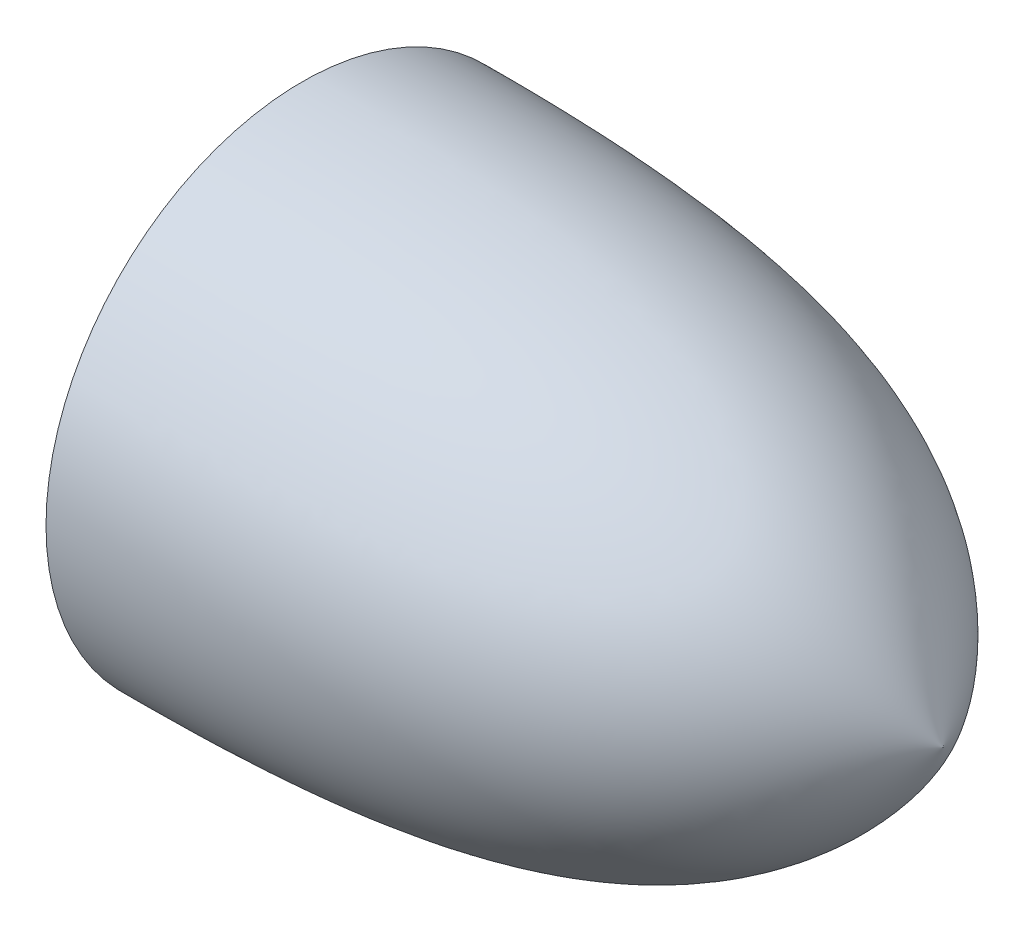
ISO-10303-21;
HEADER;
FILE_DESCRIPTION(('STEP AP214'),'2;1');
FILE_NAME('part.step','',(''),(''),'','','');
FILE_SCHEMA(('AUTOMOTIVE_DESIGN { 1 0 10303 214 1 1 1 1 }'));
ENDSEC;
DATA;
#1=APPLICATION_CONTEXT('core data for automotive mechanical design processes');
#2=APPLICATION_PROTOCOL_DEFINITION('international standard','automotive_design',2000,#1);
#3=PRODUCT_CONTEXT('',#1,'mechanical');
#4=PRODUCT('Part','Part','',(#3));
#5=PRODUCT_RELATED_PRODUCT_CATEGORY('part','',(#4));
#6=PRODUCT_DEFINITION_FORMATION('','',#4);
#7=PRODUCT_DEFINITION_CONTEXT('part definition',#1,'design');
#8=PRODUCT_DEFINITION('design','',#6,#7);
#9=PRODUCT_DEFINITION_SHAPE('','',#8);
#10=(LENGTH_UNIT() NAMED_UNIT(*) SI_UNIT(.MILLI.,.METRE.));
#11=(NAMED_UNIT(*) PLANE_ANGLE_UNIT() SI_UNIT($,.RADIAN.));
#12=(NAMED_UNIT(*) SI_UNIT($,.STERADIAN.) SOLID_ANGLE_UNIT());
#13=UNCERTAINTY_MEASURE_WITH_UNIT(LENGTH_MEASURE(1.E-05),#10,'distance_accuracy_value','');
#14=(GEOMETRIC_REPRESENTATION_CONTEXT(3) GLOBAL_UNCERTAINTY_ASSIGNED_CONTEXT((#13)) GLOBAL_UNIT_ASSIGNED_CONTEXT((#10,
#11,#12)) REPRESENTATION_CONTEXT('',''));
#15=CARTESIAN_POINT('',(0.,0.,0.));
#16=DIRECTION('',(0.,0.,1.));
#17=DIRECTION('',(1.,0.,0.));
#18=AXIS2_PLACEMENT_3D('',#15,#16,#17);
#19=CARTESIAN_POINT('',(5.,0.,0.));
#20=CARTESIAN_POINT('',(4.18698560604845,0.,-1.66857401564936));
#21=CARTESIAN_POINT('',(2.65511501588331,0.,-2.00864573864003));
#22=CARTESIAN_POINT('',(0.,0.,-2.));
#23=B_SPLINE_CURVE_WITH_KNOTS('',3,(#19,#20,#21,#22),.UNSPECIFIED.,.F.,.F.,(4,4),(0.,
0.789485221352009),.UNSPECIFIED.);
#24=CARTESIAN_POINT('',(-6.1095422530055,0.,0.));
#25=DIRECTION('',(-1.,0.,0.));
#26=AXIS1_PLACEMENT('',#24,#25);
#27=SURFACE_OF_REVOLUTION('',#23,#26);
#28=CARTESIAN_POINT('',(0.,0.,0.));
#29=DIRECTION('',(-1.,0.,0.));
#30=DIRECTION('',(0.,0.,1.));
#31=AXIS2_PLACEMENT_3D('',#28,#29,#30);
#32=CIRCLE('',#31,2.);
#33=CARTESIAN_POINT('',(0.,0.,2.));
#34=VERTEX_POINT('',#33);
#35=EDGE_CURVE('E11',#34,#34,#32,.T.);
#36=ORIENTED_EDGE('',*,*,#35,.F.);
#37=EDGE_LOOP('',(#36));
#38=FACE_BOUND('',#37,.T.);
#39=CARTESIAN_POINT('',(5.,0.,0.));
#40=VERTEX_POINT('',#39);
#41=VERTEX_LOOP('',#40);
#42=FACE_BOUND('',#41,.T.);
#43=ADVANCED_FACE('F32',(#38,#42),#27,.T.);
#44=CARTESIAN_POINT('',(0.,0.,-2.));
#45=DIRECTION('',(1.,0.,0.));
#46=DIRECTION('',(0.,0.,-1.));
#47=AXIS2_PLACEMENT_3D('',#44,#45,#46);
#48=PLANE('',#47);
#49=CARTESIAN_POINT('',(0.,0.,0.));
#50=DIRECTION('',(-1.,0.,0.));
#51=DIRECTION('',(0.,0.,1.));
#52=AXIS2_PLACEMENT_3D('',#49,#50,#51);
#53=CIRCLE('',#52,0.5);
#54=CARTESIAN_POINT('',(0.,0.,0.5));
#55=VERTEX_POINT('',#54);
#56=EDGE_CURVE('E65',#55,#55,#53,.T.);
#57=ORIENTED_EDGE('',*,*,#56,.F.);
#58=EDGE_LOOP('',(#57));
#59=FACE_BOUND('',#58,.T.);
#60=ORIENTED_EDGE('',*,*,#35,.T.);
#61=EDGE_LOOP('',(#60));
#62=FACE_BOUND('',#61,.T.);
#63=ADVANCED_FACE('F42',(#59,#62),#48,.F.);
#64=CARTESIAN_POINT('',(3.,0.,0.));
#65=DIRECTION('',(-1.,0.,0.));
#66=DIRECTION('',(0.,0.,1.));
#67=AXIS2_PLACEMENT_3D('',#64,#65,#66);
#68=CYLINDRICAL_SURFACE('',#67,0.5);
#69=CARTESIAN_POINT('',(3.,0.,0.));
#70=DIRECTION('',(-1.,0.,0.));
#71=DIRECTION('',(0.,0.,1.));
#72=AXIS2_PLACEMENT_3D('',#69,#70,#71);
#73=CIRCLE('',#72,0.5);
#74=CARTESIAN_POINT('',(3.,0.,0.5));
#75=VERTEX_POINT('',#74);
#76=EDGE_CURVE('E38',#75,#75,#73,.T.);
#77=ORIENTED_EDGE('',*,*,#76,.F.);
#78=EDGE_LOOP('',(#77));
#79=FACE_BOUND('',#78,.T.);
#80=ORIENTED_EDGE('',*,*,#56,.T.);
#81=EDGE_LOOP('',(#80));
#82=FACE_BOUND('',#81,.T.);
#83=ADVANCED_FACE('F47',(#79,#82),#68,.F.);
#84=CARTESIAN_POINT('',(3.,0.,0.));
#85=DIRECTION('',(-1.,0.,0.));
#86=DIRECTION('',(0.,0.,1.));
#87=AXIS2_PLACEMENT_3D('',#84,#85,#86);
#88=PLANE('',#87);
#89=ORIENTED_EDGE('',*,*,#76,.T.);
#90=EDGE_LOOP('',(#89));
#91=FACE_BOUND('',#90,.T.);
#92=ADVANCED_FACE('F54',(#91),#88,.T.);
#93=CLOSED_SHELL('',(#43,#63,#83,#92));
#94=MANIFOLD_SOLID_BREP('B2',#93);
#95=ADVANCED_BREP_SHAPE_REPRESENTATION('',(#18,#94),#14);
#96=SHAPE_DEFINITION_REPRESENTATION(#9,#95);
ENDSEC;
END-ISO-10303-21;
